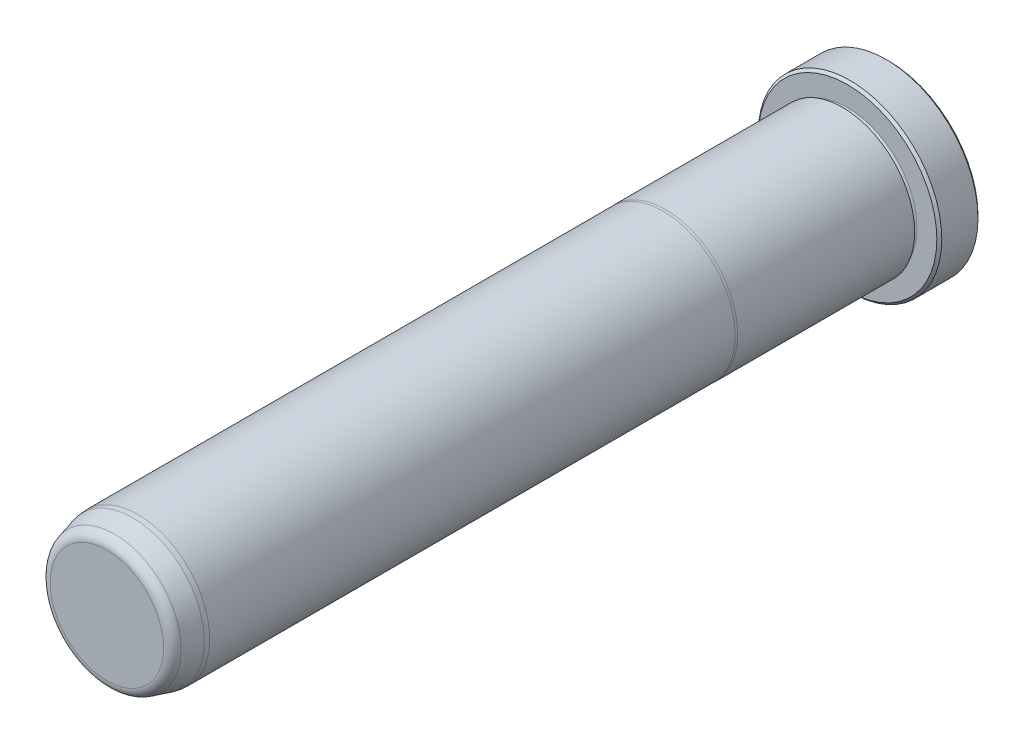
from build123d import *

# Parameters (mm, degrees)
FILLET6_R     = 1.5875
CHAMFER1_SIZE = 0.381


with BuildPart() as part:
    # Sketch1 → Revolve1 (revolve)
    with BuildSketch(Plane(origin=(0, 0, 0), x_dir=(0, 0, -1), z_dir=(1, 0, 0)), mode=Mode.PRIVATE) as revolve1_sk:
        with BuildLine():
            Line((0, 0), (0, 14.1605))
            Line((0, 14.1605), (-6.35, 14.1605))
            Line((-6.35, 14.1605), (-6.35, 10.7188))
            ThreePointArc((-6.35, 10.7188), (-6.731, 10.3378), (-7.112, 10.7188))
            Line((-7.112, 10.7188), (-7.112, 11.1252))
            Line((-7.112, 11.1252), (-34.434763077, 11.1252))
            Line((-34.434763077, 11.1252), (-34.798, 11.0998))
            Line((-34.798, 11.0998), (-115.8875, 11.0998))
            Line((-115.8875, 11.0998), (-116.6495, 11.033133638))
            Line((-116.6495, 11.033133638), (-120.65, 9.961202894))
            Line((-120.65, 9.961202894), (-120.65, 0))
            Line((-120.65, 0), (0, 0))
        make_face()
    revolve(revolve1_sk.sketch.rotate(Axis((0, 0, 0), (0, 0, -1)), 90), axis=Axis((0, 0, 0), (0, 0, -1)))

    # Fillet6
    fillet6_edges = [part.edges().sort_by_distance(p)[0] for p in [
        (-9.961202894, 0, 120.65),
    ]]
    fillet(fillet6_edges, radius=FILLET6_R)

    # Chamfer1
    chamfer1_edges = [part.edges().sort_by_distance(p)[0] for p in [
        (-14.1605, 0, 6.35),
        (-14.1605, 0, 0),
    ]]
    chamfer(chamfer1_edges, length=CHAMFER1_SIZE)


solid = part.part
